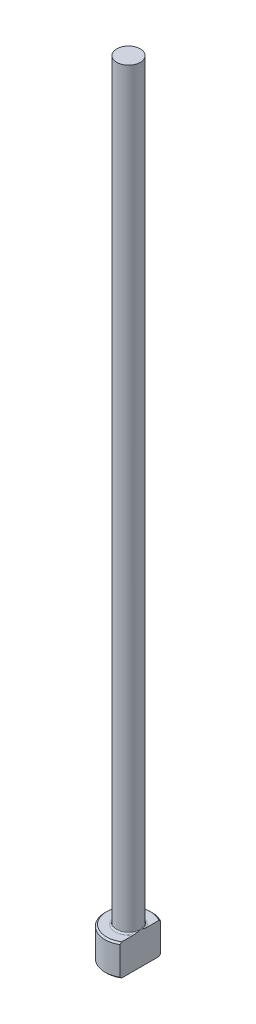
ISO-10303-21;
HEADER;
FILE_DESCRIPTION(('STEP AP214'),'2;1');
FILE_NAME('part.step','',(''),(''),'','','');
FILE_SCHEMA(('AUTOMOTIVE_DESIGN { 1 0 10303 214 1 1 1 1 }'));
ENDSEC;
DATA;
#1=APPLICATION_CONTEXT('core data for automotive mechanical design processes');
#2=APPLICATION_PROTOCOL_DEFINITION('international standard','automotive_design',2000,#1);
#3=PRODUCT_CONTEXT('',#1,'mechanical');
#4=PRODUCT('Part','Part','',(#3));
#5=PRODUCT_RELATED_PRODUCT_CATEGORY('part','',(#4));
#6=PRODUCT_DEFINITION_FORMATION('','',#4);
#7=PRODUCT_DEFINITION_CONTEXT('part definition',#1,'design');
#8=PRODUCT_DEFINITION('design','',#6,#7);
#9=PRODUCT_DEFINITION_SHAPE('','',#8);
#10=(LENGTH_UNIT() NAMED_UNIT(*) SI_UNIT(.MILLI.,.METRE.));
#11=(NAMED_UNIT(*) PLANE_ANGLE_UNIT() SI_UNIT($,.RADIAN.));
#12=(NAMED_UNIT(*) SI_UNIT($,.STERADIAN.) SOLID_ANGLE_UNIT());
#13=UNCERTAINTY_MEASURE_WITH_UNIT(LENGTH_MEASURE(1.E-05),#10,'distance_accuracy_value','');
#14=(GEOMETRIC_REPRESENTATION_CONTEXT(3) GLOBAL_UNCERTAINTY_ASSIGNED_CONTEXT((#13)) GLOBAL_UNIT_ASSIGNED_CONTEXT((#10,
#11,#12)) REPRESENTATION_CONTEXT('',''));
#15=CARTESIAN_POINT('',(0.,0.,0.));
#16=DIRECTION('',(0.,0.,1.));
#17=DIRECTION('',(1.,0.,0.));
#18=AXIS2_PLACEMENT_3D('',#15,#16,#17);
#19=CARTESIAN_POINT('',(0.,0.,0.));
#20=DIRECTION('',(0.,-1.,0.));
#21=DIRECTION('',(0.,0.,-1.));
#22=AXIS2_PLACEMENT_3D('',#19,#20,#21);
#23=PLANE('',#22);
#24=CARTESIAN_POINT('',(0.,0.,0.));
#25=DIRECTION('',(0.,-1.,0.));
#26=DIRECTION('',(0.,0.,-1.));
#27=AXIS2_PLACEMENT_3D('',#24,#25,#26);
#28=CIRCLE('',#27,2.79999999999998);
#29=CARTESIAN_POINT('',(1.49999999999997,0.,2.36431808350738));
#30=VERTEX_POINT('',#29);
#31=CARTESIAN_POINT('',(1.49999999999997,0.,-2.36431808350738));
#32=VERTEX_POINT('',#31);
#33=EDGE_CURVE('E98',#30,#32,#28,.T.);
#34=ORIENTED_EDGE('',*,*,#33,.T.);
#35=DIRECTION('',(0.,0.,1.));
#36=VECTOR('',#35,1.);
#37=CARTESIAN_POINT('',(1.49999999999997,0.,2.5980762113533));
#38=LINE('',#37,#36);
#39=EDGE_CURVE('E83',#32,#30,#38,.T.);
#40=ORIENTED_EDGE('',*,*,#39,.T.);
#41=EDGE_LOOP('',(#34,#40));
#42=FACE_BOUND('',#41,.T.);
#43=ADVANCED_FACE('F32',(#42),#23,.T.);
#44=CARTESIAN_POINT('',(0.,259.958771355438,0.));
#45=DIRECTION('',(0.,1.,0.));
#46=DIRECTION('',(0.,0.,1.));
#47=AXIS2_PLACEMENT_3D('',#44,#45,#46);
#48=CYLINDRICAL_SURFACE('',#47,2.99999999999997);
#49=CARTESIAN_POINT('',(0.,3.80000000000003,0.));
#50=DIRECTION('',(0.,1.,0.));
#51=DIRECTION('',(0.,0.,1.));
#52=AXIS2_PLACEMENT_3D('',#49,#50,#51);
#53=CIRCLE('',#52,2.99999999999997);
#54=CARTESIAN_POINT('',(1.49999999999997,3.80000000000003,2.5980762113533));
#55=VERTEX_POINT('',#54);
#56=CARTESIAN_POINT('',(1.49999999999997,3.80000000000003,-2.5980762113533));
#57=VERTEX_POINT('',#56);
#58=EDGE_CURVE('E104',#55,#57,#53,.F.);
#59=ORIENTED_EDGE('',*,*,#58,.T.);
#60=DIRECTION('',(0.,-1.,0.));
#61=VECTOR('',#60,1.);
#62=CARTESIAN_POINT('',(1.49999999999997,100.,-2.5980762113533));
#63=LINE('',#62,#61);
#64=CARTESIAN_POINT('',(1.49999999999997,0.199999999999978,-2.5980762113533));
#65=VERTEX_POINT('',#64);
#66=EDGE_CURVE('E183',#57,#65,#63,.T.);
#67=ORIENTED_EDGE('',*,*,#66,.T.);
#68=CARTESIAN_POINT('',(0.,0.199999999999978,0.));
#69=DIRECTION('',(0.,-1.,0.));
#70=DIRECTION('',(0.,0.,-1.));
#71=AXIS2_PLACEMENT_3D('',#68,#69,#70);
#72=CIRCLE('',#71,2.99999999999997);
#73=CARTESIAN_POINT('',(1.49999999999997,0.199999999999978,2.5980762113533));
#74=VERTEX_POINT('',#73);
#75=EDGE_CURVE('E100',#65,#74,#72,.F.);
#76=ORIENTED_EDGE('',*,*,#75,.T.);
#77=DIRECTION('',(0.,-1.,0.));
#78=VECTOR('',#77,1.);
#79=CARTESIAN_POINT('',(1.49999999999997,100.,2.5980762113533));
#80=LINE('',#79,#78);
#81=EDGE_CURVE('E93',#55,#74,#80,.T.);
#82=ORIENTED_EDGE('',*,*,#81,.F.);
#83=EDGE_LOOP('',(#59,#67,#76,#82));
#84=FACE_BOUND('',#83,.T.);
#85=ADVANCED_FACE('F158',(#84),#48,.T.);
#86=CARTESIAN_POINT('',(-2.99999999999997,4.,0.));
#87=DIRECTION('',(0.,1.,0.));
#88=DIRECTION('',(0.,0.,1.));
#89=AXIS2_PLACEMENT_3D('',#86,#87,#88);
#90=PLANE('',#89);
#91=CARTESIAN_POINT('',(0.,4.,0.));
#92=DIRECTION('',(0.,1.,0.));
#93=DIRECTION('',(0.,0.,1.));
#94=AXIS2_PLACEMENT_3D('',#91,#92,#93);
#95=CIRCLE('',#94,2.8);
#96=CARTESIAN_POINT('',(1.49999999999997,4.,-2.3643180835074));
#97=VERTEX_POINT('',#96);
#98=CARTESIAN_POINT('',(1.49999999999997,4.,2.3643180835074));
#99=VERTEX_POINT('',#98);
#100=EDGE_CURVE('E178',#97,#99,#95,.T.);
#101=ORIENTED_EDGE('',*,*,#100,.T.);
#102=DIRECTION('',(0.,0.,-1.));
#103=VECTOR('',#102,1.);
#104=CARTESIAN_POINT('',(1.49999999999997,4.,0.));
#105=LINE('',#104,#103);
#106=CARTESIAN_POINT('',(1.49999999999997,3.99999999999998,0.799999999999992));
#107=VERTEX_POINT('',#106);
#108=EDGE_CURVE('E57',#99,#107,#105,.T.);
#109=ORIENTED_EDGE('',*,*,#108,.T.);
#110=CARTESIAN_POINT('',(0.,4.,0.));
#111=DIRECTION('',(0.,1.,0.));
#112=DIRECTION('',(0.,0.,1.));
#113=AXIS2_PLACEMENT_3D('',#110,#111,#112);
#114=CIRCLE('',#113,1.69999999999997);
#115=CARTESIAN_POINT('',(1.49999999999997,3.99999999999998,-0.799999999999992));
#116=VERTEX_POINT('',#115);
#117=EDGE_CURVE('E107',#107,#116,#114,.F.);
#118=ORIENTED_EDGE('',*,*,#117,.T.);
#119=EDGE_CURVE('E136',#116,#97,#105,.T.);
#120=ORIENTED_EDGE('',*,*,#119,.T.);
#121=EDGE_LOOP('',(#101,#109,#118,#120));
#122=FACE_BOUND('',#121,.T.);
#123=ADVANCED_FACE('F147',(#122),#90,.T.);
#124=CARTESIAN_POINT('',(0.,4.,0.));
#125=DIRECTION('',(0.,-1.,0.));
#126=DIRECTION('',(0.,0.,-1.));
#127=AXIS2_PLACEMENT_3D('',#124,#125,#126);
#128=CONICAL_SURFACE('',#127,2.8,0.785398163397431);
#129=ORIENTED_EDGE('',*,*,#58,.F.);
#130=CARTESIAN_POINT('',(1.49999999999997,0.888258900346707,5.71827621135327));
#131=CARTESIAN_POINT('',(1.49999999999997,1.01361833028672,5.58866816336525));
#132=CARTESIAN_POINT('',(1.49999999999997,1.13884324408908,5.45892957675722));
#133=CARTESIAN_POINT('',(1.49999999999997,1.38894444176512,5.19911365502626));
#134=CARTESIAN_POINT('',(1.49999999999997,1.51382072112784,5.06903631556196));
#135=CARTESIAN_POINT('',(1.49999999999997,1.76320568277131,4.80840180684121));
#136=CARTESIAN_POINT('',(1.49999999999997,1.88771414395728,4.67784442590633));
#137=CARTESIAN_POINT('',(1.49999999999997,2.13618059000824,4.4162081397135));
#138=CARTESIAN_POINT('',(1.49999999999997,2.26013857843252,4.28512923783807));
#139=CARTESIAN_POINT('',(1.49999999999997,2.50488975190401,4.02490837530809));
#140=CARTESIAN_POINT('',(1.49999999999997,2.62569693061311,3.8957795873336));
#141=CARTESIAN_POINT('',(1.49999999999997,2.86640694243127,3.63668213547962));
#142=CARTESIAN_POINT('',(1.49999999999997,2.9863097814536,3.50671347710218));
#143=CARTESIAN_POINT('',(1.49999999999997,3.22486033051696,3.24567921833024));
#144=CARTESIAN_POINT('',(1.49999999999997,3.34350830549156,3.11461386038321));
#145=CARTESIAN_POINT('',(1.49999999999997,3.57907716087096,2.85094268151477));
#146=CARTESIAN_POINT('',(1.49999999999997,3.69599811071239,2.71833692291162));
#147=CARTESIAN_POINT('',(1.49999999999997,3.88262371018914,2.50255231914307));
#148=CARTESIAN_POINT('',(1.49999999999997,3.9531245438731,2.42006293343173));
#149=CARTESIAN_POINT('',(1.49999999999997,4.09287098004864,2.254010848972));
#150=CARTESIAN_POINT('',(1.49999999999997,4.16211645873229,2.17044804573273));
#151=CARTESIAN_POINT('',(1.49999999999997,4.29964684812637,2.00105967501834));
#152=CARTESIAN_POINT('',(1.49999999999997,4.36791386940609,1.9152195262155));
#153=CARTESIAN_POINT('',(1.49999999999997,4.50205840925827,1.7417139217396));
#154=CARTESIAN_POINT('',(1.49999999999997,4.56793649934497,1.65404891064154));
#155=CARTESIAN_POINT('',(1.49999999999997,4.69728151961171,1.47490236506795));
#156=CARTESIAN_POINT('',(1.49999999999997,4.76069661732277,1.38338308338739));
#157=CARTESIAN_POINT('',(1.49999999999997,4.88239539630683,1.19675661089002));
#158=CARTESIAN_POINT('',(1.49999999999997,4.94067201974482,1.10164473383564));
#159=CARTESIAN_POINT('',(1.49999999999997,5.04841325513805,0.908008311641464));
#160=CARTESIAN_POINT('',(1.49999999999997,5.09797809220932,0.809540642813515));
#161=CARTESIAN_POINT('',(1.49999999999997,5.18432188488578,0.607192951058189));
#162=CARTESIAN_POINT('',(1.49999999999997,5.22114374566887,0.50333247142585));
#163=CARTESIAN_POINT('',(1.49999999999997,5.26099935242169,0.347577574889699));
#164=CARTESIAN_POINT('',(1.49999999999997,5.27157029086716,0.297609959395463));
#165=CARTESIAN_POINT('',(1.49999999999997,5.28794860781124,0.196885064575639));
#166=CARTESIAN_POINT('',(1.49999999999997,5.29375640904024,0.146127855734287));
#167=CARTESIAN_POINT('',(1.49999999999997,5.30019707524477,0.0444388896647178));
#168=CARTESIAN_POINT('',(1.49999999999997,5.30084594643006,-0.00649183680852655));
#169=CARTESIAN_POINT('',(1.49999999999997,5.29696416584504,-0.108155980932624));
#170=CARTESIAN_POINT('',(1.49999999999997,5.29243308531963,-0.158889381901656));
#171=CARTESIAN_POINT('',(1.49999999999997,5.27856915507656,-0.25923447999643));
#172=CARTESIAN_POINT('',(1.49999999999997,5.26927821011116,-0.308852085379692));
#173=CARTESIAN_POINT('',(1.49999999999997,5.24647108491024,-0.407110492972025));
#174=CARTESIAN_POINT('',(1.49999999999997,5.23295324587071,-0.455750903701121));
#175=CARTESIAN_POINT('',(1.49999999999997,5.20226175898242,-0.552149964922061));
#176=CARTESIAN_POINT('',(1.49999999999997,5.18506801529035,-0.599902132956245));
#177=CARTESIAN_POINT('',(1.49999999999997,5.14771387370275,-0.694205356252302));
#178=CARTESIAN_POINT('',(1.49999999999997,5.12755408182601,-0.740756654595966));
#179=CARTESIAN_POINT('',(1.49999999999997,5.06327696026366,-0.879166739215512));
#180=CARTESIAN_POINT('',(1.49999999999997,5.0155172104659,-0.969329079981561));
#181=CARTESIAN_POINT('',(1.49999999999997,4.9136790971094,-1.14604316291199));
#182=CARTESIAN_POINT('',(1.49999999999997,4.85959300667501,-1.2325903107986));
#183=CARTESIAN_POINT('',(1.49999999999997,4.74697968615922,-1.40321348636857));
#184=CARTESIAN_POINT('',(1.49999999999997,4.68843573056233,-1.4872783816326));
#185=CARTESIAN_POINT('',(1.49999999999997,4.56843845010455,-1.65322187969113));
#186=CARTESIAN_POINT('',(1.49999999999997,4.50698656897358,-1.73510153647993));
#187=CARTESIAN_POINT('',(1.49999999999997,4.38115673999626,-1.89829823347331));
#188=CARTESIAN_POINT('',(1.49999999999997,4.31675092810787,-1.97959369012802));
#189=CARTESIAN_POINT('',(1.49999999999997,4.18634068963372,-2.14090082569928));
#190=CARTESIAN_POINT('',(1.49999999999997,4.1203360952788,-2.22091236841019));
#191=CARTESIAN_POINT('',(1.49999999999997,3.92086431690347,-2.45906508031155));
#192=CARTESIAN_POINT('',(1.49999999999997,3.78562663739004,-2.61572090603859));
#193=CARTESIAN_POINT('',(1.49999999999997,3.53554498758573,-2.90006295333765));
#194=CARTESIAN_POINT('',(1.49999999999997,3.42114543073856,-3.02814382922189));
#195=CARTESIAN_POINT('',(1.49999999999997,3.19093557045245,-3.28303767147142));
#196=CARTESIAN_POINT('',(1.49999999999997,3.0751252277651,-3.40985060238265));
#197=CARTESIAN_POINT('',(1.49999999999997,2.72597067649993,-3.78913849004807));
#198=CARTESIAN_POINT('',(1.49999999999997,2.49111760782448,-4.04022177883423));
#199=CARTESIAN_POINT('',(1.49999999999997,2.02882478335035,-4.52992803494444));
#200=CARTESIAN_POINT('',(1.49999999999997,1.80147747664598,-4.76863870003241));
#201=CARTESIAN_POINT('',(1.49999999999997,1.45954865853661,-5.12558036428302));
#202=CARTESIAN_POINT('',(1.49999999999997,1.34548484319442,-5.24430773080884));
#203=CARTESIAN_POINT('',(1.49999999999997,1.11707176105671,-5.48148573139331));
#204=CARTESIAN_POINT('',(1.49999999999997,1.00272249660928,-5.59993636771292));
#205=CARTESIAN_POINT('',(1.49999999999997,0.888258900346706,-5.71827621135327));
#206=B_SPLINE_CURVE_WITH_KNOTS('',3,(#130,#131,#132,#133,#134,#135,#136,#137,#138,#139,#140,
#141,#142,#143,#144,#145,#146,#147,#148,#149,#150,#151,#152,#153,#154,#155,#156,#157,#158,#159,
#160,#161,#162,#163,#164,#165,#166,#167,#168,#169,#170,#171,#172,#173,#174,#175,#176,#177,#178,
#179,#180,#181,#182,#183,#184,#185,#186,#187,#188,#189,#190,#191,#192,#193,#194,#195,#196,#197,
#198,#199,#200,#201,#202,#203,#204,#205),.UNSPECIFIED.,.F.,.F.,(4,2,2,2,2,2,2,2,2,2,2,2,2,2,2,2,
2,2,2,2,2,2,2,2,2,2,2,2,2,2,2,2,2,2,2,2,2,4),(0.,0.540943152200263,1.08189327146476,
1.62312052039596,2.16434426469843,2.69482920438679,3.22531067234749,3.75567781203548,
4.28602356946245,4.611550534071,4.9371094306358,5.26610945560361,5.59503024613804,
5.92894782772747,6.26331713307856,6.59354403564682,6.92264800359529,7.07567478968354,
7.22868799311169,7.38122626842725,7.53377717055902,7.6850075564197,7.83629736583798,
7.98843643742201,8.14054446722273,8.44618799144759,8.75220879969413,9.05944044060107,
9.3665211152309,9.6776428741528,9.98879742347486,10.609592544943,11.1247803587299,
11.6399825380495,12.6713544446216,13.6603005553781,14.1542238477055,14.6481430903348),.UNSPECIFIED.);
#207=EDGE_CURVE('E135',#55,#99,#206,.T.);
#208=ORIENTED_EDGE('',*,*,#207,.T.);
#209=ORIENTED_EDGE('',*,*,#100,.F.);
#210=EDGE_CURVE('E127',#97,#57,#206,.T.);
#211=ORIENTED_EDGE('',*,*,#210,.T.);
#212=EDGE_LOOP('',(#129,#208,#209,#211));
#213=FACE_BOUND('',#212,.T.);
#214=ADVANCED_FACE('F143',(#213),#128,.T.);
#215=CARTESIAN_POINT('',(0.,0.199999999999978,0.));
#216=DIRECTION('',(0.,1.,0.));
#217=DIRECTION('',(0.,0.,1.));
#218=AXIS2_PLACEMENT_3D('',#215,#216,#217);
#219=CONICAL_SURFACE('',#218,2.99999999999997,0.785398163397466);
#220=ORIENTED_EDGE('',*,*,#75,.F.);
#221=CARTESIAN_POINT('',(1.49999999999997,3.11174109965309,-5.71827621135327));
#222=CARTESIAN_POINT('',(1.49999999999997,2.9863816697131,-5.58866816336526));
#223=CARTESIAN_POINT('',(1.49999999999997,2.86115675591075,-5.45892957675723));
#224=CARTESIAN_POINT('',(1.49999999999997,2.61105555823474,-5.19911365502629));
#225=CARTESIAN_POINT('',(1.49999999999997,2.48617927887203,-5.06903631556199));
#226=CARTESIAN_POINT('',(1.49999999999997,2.23679431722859,-4.80840180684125));
#227=CARTESIAN_POINT('',(1.49999999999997,2.11228585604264,-4.67784442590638));
#228=CARTESIAN_POINT('',(1.49999999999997,1.86381940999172,-4.41620813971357));
#229=CARTESIAN_POINT('',(1.49999999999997,1.73986142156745,-4.28512923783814));
#230=CARTESIAN_POINT('',(1.49999999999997,1.49511024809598,-4.02490837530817));
#231=CARTESIAN_POINT('',(1.49999999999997,1.3743030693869,-3.89577958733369));
#232=CARTESIAN_POINT('',(1.49999999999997,1.13359305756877,-3.63668213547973));
#233=CARTESIAN_POINT('',(1.49999999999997,1.01369021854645,-3.50671347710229));
#234=CARTESIAN_POINT('',(1.49999999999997,0.775139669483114,-3.24567921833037));
#235=CARTESIAN_POINT('',(1.49999999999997,0.656491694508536,-3.11461386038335));
#236=CARTESIAN_POINT('',(1.49999999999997,0.420922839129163,-2.85094268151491));
#237=CARTESIAN_POINT('',(1.49999999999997,0.304001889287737,-2.71833692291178));
#238=CARTESIAN_POINT('',(1.49999999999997,0.117376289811,-2.50255231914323));
#239=CARTESIAN_POINT('',(1.49999999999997,0.0468754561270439,-2.42006293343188));
#240=CARTESIAN_POINT('',(1.49999999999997,-0.0928709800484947,-2.25401084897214));
#241=CARTESIAN_POINT('',(1.49999999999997,-0.162116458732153,-2.17044804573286));
#242=CARTESIAN_POINT('',(1.49999999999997,-0.299646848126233,-2.00105967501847));
#243=CARTESIAN_POINT('',(1.49999999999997,-0.367913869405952,-1.91521952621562));
#244=CARTESIAN_POINT('',(1.49999999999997,-0.502058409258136,-1.74171392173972));
#245=CARTESIAN_POINT('',(1.49999999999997,-0.567936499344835,-1.65404891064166));
#246=CARTESIAN_POINT('',(1.49999999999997,-0.697281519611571,-1.47490236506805));
#247=CARTESIAN_POINT('',(1.49999999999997,-0.760696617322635,-1.38338308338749));
#248=CARTESIAN_POINT('',(1.49999999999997,-0.882395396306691,-1.19675661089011));
#249=CARTESIAN_POINT('',(1.49999999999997,-0.940672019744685,-1.10164473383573));
#250=CARTESIAN_POINT('',(1.49999999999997,-1.04841325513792,-0.908008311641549));
#251=CARTESIAN_POINT('',(1.49999999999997,-1.09797809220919,-0.809540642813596));
#252=CARTESIAN_POINT('',(1.49999999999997,-1.18432188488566,-0.607192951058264));
#253=CARTESIAN_POINT('',(1.49999999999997,-1.22114374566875,-0.503332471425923));
#254=CARTESIAN_POINT('',(1.49999999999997,-1.26099935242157,-0.347577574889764));
#255=CARTESIAN_POINT('',(1.49999999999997,-1.27157029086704,-0.297609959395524));
#256=CARTESIAN_POINT('',(1.49999999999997,-1.28794860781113,-0.19688506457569));
#257=CARTESIAN_POINT('',(1.49999999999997,-1.29375640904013,-0.146127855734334));
#258=CARTESIAN_POINT('',(1.49999999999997,-1.30019707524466,-0.0444388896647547));
#259=CARTESIAN_POINT('',(1.49999999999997,-1.30084594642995,0.00649183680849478));
#260=CARTESIAN_POINT('',(1.49999999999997,-1.29696416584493,0.108155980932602));
#261=CARTESIAN_POINT('',(1.49999999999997,-1.29243308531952,0.158889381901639));
#262=CARTESIAN_POINT('',(1.49999999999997,-1.27856915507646,0.259234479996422));
#263=CARTESIAN_POINT('',(1.49999999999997,-1.26927821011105,0.308852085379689));
#264=CARTESIAN_POINT('',(1.49999999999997,-1.24647108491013,0.407110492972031));
#265=CARTESIAN_POINT('',(1.49999999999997,-1.2329532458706,0.455750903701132));
#266=CARTESIAN_POINT('',(1.49999999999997,-1.20226175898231,0.552149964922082));
#267=CARTESIAN_POINT('',(1.49999999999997,-1.18506801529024,0.59990213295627));
#268=CARTESIAN_POINT('',(1.49999999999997,-1.14771387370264,0.694205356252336));
#269=CARTESIAN_POINT('',(1.49999999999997,-1.1275540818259,0.740756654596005));
#270=CARTESIAN_POINT('',(1.49999999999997,-1.06327696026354,0.879166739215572));
#271=CARTESIAN_POINT('',(1.49999999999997,-1.01551721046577,0.969329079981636));
#272=CARTESIAN_POINT('',(1.49999999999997,-0.913679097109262,1.1460431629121));
#273=CARTESIAN_POINT('',(1.49999999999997,-0.859593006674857,1.23259031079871));
#274=CARTESIAN_POINT('',(1.49999999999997,-0.74697968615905,1.40321348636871));
#275=CARTESIAN_POINT('',(1.49999999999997,-0.688435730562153,1.48727838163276));
#276=CARTESIAN_POINT('',(1.49999999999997,-0.568438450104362,1.65322187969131));
#277=CARTESIAN_POINT('',(1.49999999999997,-0.506986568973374,1.73510153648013));
#278=CARTESIAN_POINT('',(1.49999999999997,-0.381156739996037,1.89829823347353));
#279=CARTESIAN_POINT('',(1.49999999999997,-0.316750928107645,1.97959369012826));
#280=CARTESIAN_POINT('',(1.49999999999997,-0.186340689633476,2.14090082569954));
#281=CARTESIAN_POINT('',(1.49999999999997,-0.120336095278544,2.22091236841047));
#282=CARTESIAN_POINT('',(1.49999999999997,0.0791356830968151,2.45906508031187));
#283=CARTESIAN_POINT('',(1.49999999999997,0.214373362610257,2.61572090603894));
#284=CARTESIAN_POINT('',(1.49999999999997,0.464455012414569,2.900062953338));
#285=CARTESIAN_POINT('',(1.49999999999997,0.578854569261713,3.02814382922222));
#286=CARTESIAN_POINT('',(1.49999999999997,0.809064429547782,3.28303767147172));
#287=CARTESIAN_POINT('',(1.49999999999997,0.924874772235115,3.40985060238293));
#288=CARTESIAN_POINT('',(1.49999999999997,1.27402932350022,3.7891384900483));
#289=CARTESIAN_POINT('',(1.49999999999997,1.50888239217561,4.04022177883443));
#290=CARTESIAN_POINT('',(1.49999999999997,1.97117521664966,4.52992803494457));
#291=CARTESIAN_POINT('',(1.49999999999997,2.19852252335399,4.76863870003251));
#292=CARTESIAN_POINT('',(1.49999999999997,2.54045134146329,5.12558036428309));
#293=CARTESIAN_POINT('',(1.49999999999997,2.65451515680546,5.2443077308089));
#294=CARTESIAN_POINT('',(1.49999999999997,2.88292823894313,5.48148573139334));
#295=CARTESIAN_POINT('',(1.49999999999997,2.99727750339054,5.59993636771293));
#296=CARTESIAN_POINT('',(1.49999999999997,3.11174109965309,5.71827621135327));
#297=B_SPLINE_CURVE_WITH_KNOTS('',3,(#221,#222,#223,#224,#225,#226,#227,#228,#229,#230,#231,
#232,#233,#234,#235,#236,#237,#238,#239,#240,#241,#242,#243,#244,#245,#246,#247,#248,#249,#250,
#251,#252,#253,#254,#255,#256,#257,#258,#259,#260,#261,#262,#263,#264,#265,#266,#267,#268,#269,
#270,#271,#272,#273,#274,#275,#276,#277,#278,#279,#280,#281,#282,#283,#284,#285,#286,#287,#288,
#289,#290,#291,#292,#293,#294,#295,#296),.UNSPECIFIED.,.F.,.F.,(4,2,2,2,2,2,2,2,2,2,2,2,2,2,2,2,
2,2,2,2,2,2,2,2,2,2,2,2,2,2,2,2,2,2,2,2,2,4),(0.,0.540943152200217,1.08189327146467,
1.62312052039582,2.16434426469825,2.69482920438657,3.22531067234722,3.75567781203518,
4.2860235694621,4.61155053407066,4.93710943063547,5.26610945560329,5.59503024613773,
5.92894782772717,6.26331713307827,6.59354403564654,6.92264800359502,7.07567478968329,
7.22868799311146,7.38122626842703,7.53377717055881,7.6850075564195,7.8362973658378,
7.98843643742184,8.14054446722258,8.44618799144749,8.75220879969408,9.05944044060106,
9.36652111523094,9.6776428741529,9.988797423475,10.6095925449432,11.1247803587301,
11.6399825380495,12.6713544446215,13.6603005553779,14.1542238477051,14.6481430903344),.UNSPECIFIED.);
#298=EDGE_CURVE('E86',#65,#32,#297,.T.);
#299=ORIENTED_EDGE('',*,*,#298,.T.);
#300=ORIENTED_EDGE('',*,*,#33,.F.);
#301=EDGE_CURVE('E89',#30,#74,#297,.T.);
#302=ORIENTED_EDGE('',*,*,#301,.T.);
#303=EDGE_LOOP('',(#220,#299,#300,#302));
#304=FACE_BOUND('',#303,.T.);
#305=ADVANCED_FACE('F97',(#304),#219,.T.);
#306=CARTESIAN_POINT('',(0.,4.19999999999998,0.));
#307=DIRECTION('',(0.,1.,0.));
#308=DIRECTION('',(0.,0.,1.));
#309=AXIS2_PLACEMENT_3D('',#306,#307,#308);
#310=TOROIDAL_SURFACE('',#309,1.69999999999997,0.2);
#311=CARTESIAN_POINT('',(1.49999999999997,4.19999999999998,0.));
#312=CARTESIAN_POINT('',(1.49999999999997,4.20000050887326,7.14686072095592E-11));
#313=CARTESIAN_POINT('',(1.49999999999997,4.20000101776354,-1.21663673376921E-07));
#314=CARTESIAN_POINT('',(1.49999999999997,4.20000199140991,-4.97616237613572E-07));
#315=CARTESIAN_POINT('',(1.49999999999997,4.20000245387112,-7.5651622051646E-07));
#316=CARTESIAN_POINT('',(1.49999999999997,4.20000338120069,-1.37642837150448E-06));
#317=CARTESIAN_POINT('',(1.49999999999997,4.20000384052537,-1.74563476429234E-06));
#318=CARTESIAN_POINT('',(1.49999999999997,4.20000469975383,-2.53565984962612E-06));
#319=CARTESIAN_POINT('',(1.49999999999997,4.20000510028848,-2.95582597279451E-06));
#320=CARTESIAN_POINT('',(1.49999999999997,4.20000646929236,-4.48430445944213E-06));
#321=CARTESIAN_POINT('',(1.49999999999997,4.20000736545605,-5.65861039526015E-06));
#322=CARTESIAN_POINT('',(1.49999999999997,4.20000893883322,-8.06479202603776E-06));
#323=CARTESIAN_POINT('',(1.49999999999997,4.20000962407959,-9.29170517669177E-06));
#324=CARTESIAN_POINT('',(1.49999999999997,4.20001225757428,-1.416232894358E-05));
#325=CARTESIAN_POINT('',(1.49999999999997,4.20001407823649,-1.78790031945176E-05));
#326=CARTESIAN_POINT('',(1.49999999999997,4.20001699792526,-2.51443066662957E-05));
#327=CARTESIAN_POINT('',(1.49999999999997,4.20001815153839,-2.86715394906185E-05));
#328=CARTESIAN_POINT('',(1.49999999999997,4.20002315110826,-4.39218128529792E-05));
#329=CARTESIAN_POINT('',(1.49999999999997,4.20002701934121,-5.56288390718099E-05));
#330=CARTESIAN_POINT('',(1.49999999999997,4.20003312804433,-7.7405829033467E-05));
#331=CARTESIAN_POINT('',(1.49999999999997,4.20003553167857,-8.7427841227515E-05));
#332=CARTESIAN_POINT('',(1.49999999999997,4.20005483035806,-0.000161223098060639));
#333=CARTESIAN_POINT('',(1.49999999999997,4.20007979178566,-0.000222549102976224));
#334=CARTESIAN_POINT('',(1.49999999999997,4.20017391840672,-0.000462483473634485));
#335=CARTESIAN_POINT('',(1.49999999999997,4.20023706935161,-0.000642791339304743));
#336=CARTESIAN_POINT('',(1.49999999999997,4.20048761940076,-0.00134785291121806));
#337=CARTESIAN_POINT('',(1.49999999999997,4.20068132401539,-0.00187087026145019));
#338=CARTESIAN_POINT('',(1.49999999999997,4.20147357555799,-0.00402004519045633));
#339=CARTESIAN_POINT('',(1.49999999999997,4.20206499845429,-0.00564811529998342));
#340=CARTESIAN_POINT('',(1.49999999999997,4.20892634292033,-0.0245232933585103));
#341=CARTESIAN_POINT('',(1.49999999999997,4.21523683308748,-0.0417598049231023));
#342=CARTESIAN_POINT('',(1.49999999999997,4.22755028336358,-0.0756091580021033));
#343=CARTESIAN_POINT('',(1.49999999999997,4.23355589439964,-0.0922211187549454));
#344=CARTESIAN_POINT('',(1.49999999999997,4.24620101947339,-0.12745424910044));
#345=CARTESIAN_POINT('',(1.49999999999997,4.25283080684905,-0.146078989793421));
#346=CARTESIAN_POINT('',(1.49999999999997,4.26599765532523,-0.183577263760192));
#347=CARTESIAN_POINT('',(1.49999999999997,4.27253305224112,-0.202451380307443));
#348=CARTESIAN_POINT('',(1.49999999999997,4.28834228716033,-0.248982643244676));
#349=CARTESIAN_POINT('',(1.49999999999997,4.2974915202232,-0.276682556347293));
#350=CARTESIAN_POINT('',(1.49999999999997,4.31490935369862,-0.331625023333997));
#351=CARTESIAN_POINT('',(1.49999999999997,4.32319386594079,-0.35886250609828));
#352=CARTESIAN_POINT('',(1.49999999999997,4.34051594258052,-0.419125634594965));
#353=CARTESIAN_POINT('',(1.49999999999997,4.34936607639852,-0.452206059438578));
#354=CARTESIAN_POINT('',(1.49999999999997,4.36549583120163,-0.519023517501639));
#355=CARTESIAN_POINT('',(1.49999999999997,4.37276283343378,-0.55276364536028));
#356=CARTESIAN_POINT('',(1.49999999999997,4.38554755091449,-0.623053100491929));
#357=CARTESIAN_POINT('',(1.49999999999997,4.39090573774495,-0.659632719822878));
#358=CARTESIAN_POINT('',(1.49999999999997,4.39825016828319,-0.733028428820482));
#359=CARTESIAN_POINT('',(1.49999999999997,4.40024734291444,-0.769843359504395));
#360=CARTESIAN_POINT('',(1.49999999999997,4.39970780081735,-0.842856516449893));
#361=CARTESIAN_POINT('',(1.49999999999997,4.39725347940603,-0.87905368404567));
#362=CARTESIAN_POINT('',(1.49999999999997,4.38900085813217,-0.932380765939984));
#363=CARTESIAN_POINT('',(1.49999999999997,4.38553049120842,-0.949868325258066));
#364=CARTESIAN_POINT('',(1.49999999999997,4.37678336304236,-0.984374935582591));
#365=CARTESIAN_POINT('',(1.49999999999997,4.37150943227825,-1.00139467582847));
#366=CARTESIAN_POINT('',(1.49999999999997,4.35869781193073,-1.03479423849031));
#367=CARTESIAN_POINT('',(1.49999999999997,4.3511359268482,-1.05116499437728));
#368=CARTESIAN_POINT('',(1.49999999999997,4.33325333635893,-1.08234828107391));
#369=CARTESIAN_POINT('',(1.49999999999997,4.32294266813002,-1.097166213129));
#370=CARTESIAN_POINT('',(1.49999999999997,4.30512758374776,-1.11714173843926));
#371=CARTESIAN_POINT('',(1.49999999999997,4.29884721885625,-1.1233906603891));
#372=CARTESIAN_POINT('',(1.49999999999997,4.28545950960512,-1.13494695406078));
#373=CARTESIAN_POINT('',(1.49999999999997,4.27835226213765,-1.14025443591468));
#374=CARTESIAN_POINT('',(1.49999999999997,4.26325970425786,-1.14967631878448));
#375=CARTESIAN_POINT('',(1.49999999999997,4.25526534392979,-1.1537764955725));
#376=CARTESIAN_POINT('',(1.49999999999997,4.23863207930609,-1.16034952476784));
#377=CARTESIAN_POINT('',(1.49999999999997,4.22999427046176,-1.16282507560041));
#378=CARTESIAN_POINT('',(1.49999999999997,4.21343922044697,-1.16570267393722));
#379=CARTESIAN_POINT('',(1.49999999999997,4.20555896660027,-1.16631687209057));
#380=CARTESIAN_POINT('',(1.49999999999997,4.18982775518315,-1.16602054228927));
#381=CARTESIAN_POINT('',(1.49999999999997,4.18197679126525,-1.16511036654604));
#382=CARTESIAN_POINT('',(1.49999999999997,4.16747846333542,-1.16204446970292));
#383=CARTESIAN_POINT('',(1.49999999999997,4.16079696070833,-1.16004509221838));
#384=CARTESIAN_POINT('',(1.49999999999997,4.14781700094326,-1.15505972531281));
#385=CARTESIAN_POINT('',(1.49999999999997,4.14151862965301,-1.1520735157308));
#386=CARTESIAN_POINT('',(1.49999999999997,4.12690214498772,-1.14387585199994));
#387=CARTESIAN_POINT('',(1.49999999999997,4.11881436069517,-1.13825400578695));
#388=CARTESIAN_POINT('',(1.49999999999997,4.10364440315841,-1.12578441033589));
#389=CARTESIAN_POINT('',(1.49999999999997,4.09656475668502,-1.11893367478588));
#390=CARTESIAN_POINT('',(1.49999999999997,4.08012297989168,-1.10074342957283));
#391=CARTESIAN_POINT('',(1.49999999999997,4.07136543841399,-1.08886044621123));
#392=CARTESIAN_POINT('',(1.49999999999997,4.05578194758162,-1.06392743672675));
#393=CARTESIAN_POINT('',(1.49999999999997,4.0489571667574,-1.05087671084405));
#394=CARTESIAN_POINT('',(1.49999999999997,4.03273856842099,-1.0147230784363));
#395=CARTESIAN_POINT('',(1.49999999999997,4.02486230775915,-0.990945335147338));
#396=CARTESIAN_POINT('',(1.49999999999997,4.01257693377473,-0.942321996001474));
#397=CARTESIAN_POINT('',(1.49999999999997,4.00820590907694,-0.917467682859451));
#398=CARTESIAN_POINT('',(1.49999999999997,4.00229956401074,-0.867912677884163));
#399=CARTESIAN_POINT('',(1.49999999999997,4.0007128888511,-0.843217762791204));
#400=CARTESIAN_POINT('',(1.49999999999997,3.9996723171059,-0.793746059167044));
#401=CARTESIAN_POINT('',(1.49999999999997,4.0002230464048,-0.768969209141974));
#402=CARTESIAN_POINT('',(1.49999999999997,4.00433101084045,-0.696994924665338));
#403=CARTESIAN_POINT('',(1.49999999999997,4.01016976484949,-0.649931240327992));
#404=CARTESIAN_POINT('',(1.49999999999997,4.02567776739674,-0.559166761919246));
#405=CARTESIAN_POINT('',(1.49999999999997,4.03511950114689,-0.515423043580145));
#406=CARTESIAN_POINT('',(1.49999999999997,4.05693059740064,-0.427590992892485));
#407=CARTESIAN_POINT('',(1.49999999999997,4.06936356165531,-0.383518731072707));
#408=CARTESIAN_POINT('',(1.49999999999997,4.09174953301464,-0.310161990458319));
#409=CARTESIAN_POINT('',(1.49999999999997,4.10119843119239,-0.280718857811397));
#410=CARTESIAN_POINT('',(1.49999999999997,4.12060442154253,-0.222340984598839));
#411=CARTESIAN_POINT('',(1.49999999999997,4.13055519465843,-0.193404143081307));
#412=CARTESIAN_POINT('',(1.49999999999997,4.14973721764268,-0.138756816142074));
#413=CARTESIAN_POINT('',(1.49999999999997,4.15893123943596,-0.113033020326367));
#414=CARTESIAN_POINT('',(1.49999999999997,4.1778803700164,-0.0606351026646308));
#415=CARTESIAN_POINT('',(1.49999999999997,4.18764328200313,-0.0339636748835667));
#416=CARTESIAN_POINT('',(1.49999999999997,4.19793548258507,-0.00564657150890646));
#417=CARTESIAN_POINT('',(1.49999999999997,4.19852751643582,-0.00401699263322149));
#418=CARTESIAN_POINT('',(1.49999999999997,4.19931992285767,-0.00186745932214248));
#419=CARTESIAN_POINT('',(1.49999999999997,4.1995131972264,-0.00134559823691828));
#420=CARTESIAN_POINT('',(1.49999999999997,4.19976322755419,-0.000641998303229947));
#421=CARTESIAN_POINT('',(1.49999999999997,4.19982627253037,-0.000461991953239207));
#422=CARTESIAN_POINT('',(1.49999999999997,4.19992025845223,-0.000222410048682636));
#423=CARTESIAN_POINT('',(1.49999999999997,4.19994519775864,-0.000161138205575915));
#424=CARTESIAN_POINT('',(1.49999999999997,4.19996448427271,-8.74039267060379E-05));
#425=CARTESIAN_POINT('',(1.49999999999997,4.19996688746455,-7.73857556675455E-05));
#426=CARTESIAN_POINT('',(1.49999999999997,4.19997299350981,-5.56173272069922E-05));
#427=CARTESIAN_POINT('',(1.49999999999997,4.19997685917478,-4.39149186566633E-05));
#428=CARTESIAN_POINT('',(1.49999999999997,4.19998185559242,-2.86698156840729E-05));
#429=CARTESIAN_POINT('',(1.49999999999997,4.19998300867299,-2.51431575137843E-05));
#430=CARTESIAN_POINT('',(1.49999999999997,4.19998592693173,-1.78789552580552E-05));
#431=CARTESIAN_POINT('',(1.49999999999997,4.19998774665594,-1.41627846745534E-05));
#432=CARTESIAN_POINT('',(1.49999999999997,4.19999037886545,-9.29264488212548E-06));
#433=CARTESIAN_POINT('',(1.49999999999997,4.19999106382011,-8.06577599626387E-06));
#434=CARTESIAN_POINT('',(1.49999999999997,4.19999263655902,-5.65962639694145E-06));
#435=CARTESIAN_POINT('',(1.49999999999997,4.19999353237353,-4.48530466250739E-06));
#436=CARTESIAN_POINT('',(1.49999999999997,4.19999490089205,-2.95673740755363E-06));
#437=CARTESIAN_POINT('',(1.49999999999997,4.1999953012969,-2.53653208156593E-06));
#438=CARTESIAN_POINT('',(1.49999999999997,4.19999616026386,-1.74640525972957E-06));
#439=CARTESIAN_POINT('',(1.49999999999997,4.19999661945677,-1.37713598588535E-06));
#440=CARTESIAN_POINT('',(1.49999999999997,4.19999754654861,-7.57072336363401E-07));
#441=CARTESIAN_POINT('',(1.49999999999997,4.19999800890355,-4.98087387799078E-07));
#442=CARTESIAN_POINT('',(1.49999999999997,4.19999898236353,-1.21927250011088E-07));
#443=CARTESIAN_POINT('',(1.49999999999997,4.19999949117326,-7.14620692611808E-11));
#444=CARTESIAN_POINT('',(1.49999999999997,4.19999999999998,0.));
#445=B_SPLINE_CURVE_WITH_KNOTS('',3,(#311,#312,#313,#314,#315,#316,#317,#318,#319,#320,#321,
#322,#323,#324,#325,#326,#327,#328,#329,#330,#331,#332,#333,#334,#335,#336,#337,#338,#339,#340,
#341,#342,#343,#344,#345,#346,#347,#348,#349,#350,#351,#352,#353,#354,#355,#356,#357,#358,#359,
#360,#361,#362,#363,#364,#365,#366,#367,#368,#369,#370,#371,#372,#373,#374,#375,#376,#377,#378,
#379,#380,#381,#382,#383,#384,#385,#386,#387,#388,#389,#390,#391,#392,#393,#394,#395,#396,#397,
#398,#399,#400,#401,#402,#403,#404,#405,#406,#407,#408,#409,#410,#411,#412,#413,#414,#415,#416,
#417,#418,#419,#420,#421,#422,#423,#424,#425,#426,#427,#428,#429,#430,#431,#432,#433,#434,#435,
#436,#437,#438,#439,#440,#441,#442,#443,#444),.UNSPECIFIED.,.T.,.F.,(4,2,2,2,2,2,2,2,2,2,2,2,2,
2,2,2,2,2,2,2,2,2,2,2,2,2,2,2,2,2,2,2,2,2,2,2,2,2,2,2,2,2,2,2,2,2,2,2,2,2,2,2,2,2,2,2,2,2,2,2,2,
2,2,2,2,2,4),(0.,1.5268750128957E-06,3.10959387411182E-06,4.86976756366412E-06,
6.60940084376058E-06,1.10202525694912E-05,1.5232779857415E-05,2.76140371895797E-05,
3.87351645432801E-05,7.5718833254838E-05,0.000106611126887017,0.000304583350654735,
0.000878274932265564,0.00255078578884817,0.00774802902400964,0.0628090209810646,
0.115802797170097,0.175110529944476,0.235030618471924,0.322539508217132,0.407938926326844,
0.510638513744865,0.614128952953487,0.724918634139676,0.835347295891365,0.943752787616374,
0.997165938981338,1.05049564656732,1.10441029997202,1.1581307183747,1.18463966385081,
1.21114550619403,1.23795217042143,1.26471419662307,1.28828324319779,1.31184684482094,
1.33268332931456,1.35352446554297,1.38290826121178,1.41236445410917,1.45639976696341,
1.5004616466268,1.5751878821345,1.65071550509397,1.72483484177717,1.79911468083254,
1.94105061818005,2.07520625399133,2.21251544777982,2.30527614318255,2.39707056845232,
2.47902409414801,2.56422207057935,2.56942417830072,2.5710929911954,2.57166572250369,
2.57186352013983,2.5718944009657,2.57193136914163,2.57194248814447,2.57195486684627,
2.57195907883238,2.57196348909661,2.57196522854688,2.57196698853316,2.57196857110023,
2.57197009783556),.UNSPECIFIED.);
#446=CARTESIAN_POINT('',(1.49999999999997,4.19999999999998,0.));
#447=VERTEX_POINT('',#446);
#448=EDGE_CURVE('E11',#116,#447,#445,.T.);
#449=ORIENTED_EDGE('',*,*,#448,.F.);
#450=ORIENTED_EDGE('',*,*,#117,.F.);
#451=CARTESIAN_POINT('',(1.49999999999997,4.19999999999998,0.));
#452=CARTESIAN_POINT('',(1.49999999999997,4.1999994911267,-7.14686002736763E-11));
#453=CARTESIAN_POINT('',(1.49999999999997,4.19999898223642,1.21663673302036E-07));
#454=CARTESIAN_POINT('',(1.49999999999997,4.19999800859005,4.97616237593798E-07));
#455=CARTESIAN_POINT('',(1.49999999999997,4.19999754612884,7.56516220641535E-07));
#456=CARTESIAN_POINT('',(1.49999999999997,4.19999661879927,1.37642837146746E-06));
#457=CARTESIAN_POINT('',(1.49999999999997,4.1999961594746,1.74563476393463E-06));
#458=CARTESIAN_POINT('',(1.49999999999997,4.19999530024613,2.5356598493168E-06));
#459=CARTESIAN_POINT('',(1.49999999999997,4.19999489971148,2.95582597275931E-06));
#460=CARTESIAN_POINT('',(1.49999999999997,4.1999935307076,4.48430446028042E-06));
#461=CARTESIAN_POINT('',(1.49999999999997,4.19999263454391,5.65861039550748E-06));
#462=CARTESIAN_POINT('',(1.49999999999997,4.19999106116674,8.06479202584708E-06));
#463=CARTESIAN_POINT('',(1.49999999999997,4.19999037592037,9.29170517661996E-06));
#464=CARTESIAN_POINT('',(1.49999999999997,4.19998774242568,1.41623289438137E-05));
#465=CARTESIAN_POINT('',(1.49999999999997,4.19998592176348,1.78790031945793E-05));
#466=CARTESIAN_POINT('',(1.49999999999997,4.1999830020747,2.51443066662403E-05));
#467=CARTESIAN_POINT('',(1.49999999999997,4.19998184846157,2.86715394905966E-05));
#468=CARTESIAN_POINT('',(1.49999999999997,4.1999768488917,4.39218128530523E-05));
#469=CARTESIAN_POINT('',(1.49999999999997,4.19997298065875,5.56288390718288E-05));
#470=CARTESIAN_POINT('',(1.49999999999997,4.19996687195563,7.74058290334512E-05));
#471=CARTESIAN_POINT('',(1.49999999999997,4.1999644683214,8.7427841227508E-05));
#472=CARTESIAN_POINT('',(1.49999999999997,4.1999451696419,0.000161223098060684));
#473=CARTESIAN_POINT('',(1.49999999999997,4.1999202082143,0.000222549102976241));
#474=CARTESIAN_POINT('',(1.49999999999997,4.19982608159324,0.000462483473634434));
#475=CARTESIAN_POINT('',(1.49999999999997,4.19976293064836,0.000642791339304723));
#476=CARTESIAN_POINT('',(1.49999999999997,4.1995123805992,0.00134785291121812));
#477=CARTESIAN_POINT('',(1.49999999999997,4.19931867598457,0.00187087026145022));
#478=CARTESIAN_POINT('',(1.49999999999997,4.19852642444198,0.00402004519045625));
#479=CARTESIAN_POINT('',(1.49999999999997,4.19793500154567,0.00564811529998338));
#480=CARTESIAN_POINT('',(1.49999999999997,4.19107365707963,0.0245232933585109));
#481=CARTESIAN_POINT('',(1.49999999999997,4.18476316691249,0.0417598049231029));
#482=CARTESIAN_POINT('',(1.49999999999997,4.17244971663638,0.0756091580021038));
#483=CARTESIAN_POINT('',(1.49999999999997,4.16644410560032,0.0922211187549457));
#484=CARTESIAN_POINT('',(1.49999999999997,4.15379898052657,0.12745424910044));
#485=CARTESIAN_POINT('',(1.49999999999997,4.14716919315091,0.146078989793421));
#486=CARTESIAN_POINT('',(1.49999999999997,4.13400234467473,0.183577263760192));
#487=CARTESIAN_POINT('',(1.49999999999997,4.12746694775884,0.202451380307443));
#488=CARTESIAN_POINT('',(1.49999999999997,4.11165771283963,0.248982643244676));
#489=CARTESIAN_POINT('',(1.49999999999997,4.10250847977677,0.276682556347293));
#490=CARTESIAN_POINT('',(1.49999999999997,4.08509064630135,0.331625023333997));
#491=CARTESIAN_POINT('',(1.49999999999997,4.07680613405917,0.35886250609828));
#492=CARTESIAN_POINT('',(1.49999999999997,4.05948405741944,0.419125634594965));
#493=CARTESIAN_POINT('',(1.49999999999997,4.05063392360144,0.452206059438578));
#494=CARTESIAN_POINT('',(1.49999999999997,4.03450416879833,0.51902351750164));
#495=CARTESIAN_POINT('',(1.49999999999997,4.02723716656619,0.55276364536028));
#496=CARTESIAN_POINT('',(1.49999999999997,4.01445244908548,0.623053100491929));
#497=CARTESIAN_POINT('',(1.49999999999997,4.00909426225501,0.659632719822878));
#498=CARTESIAN_POINT('',(1.49999999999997,4.00174983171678,0.733028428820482));
#499=CARTESIAN_POINT('',(1.49999999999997,3.99975265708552,0.769843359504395));
#500=CARTESIAN_POINT('',(1.49999999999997,4.00029219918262,0.842856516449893));
#501=CARTESIAN_POINT('',(1.49999999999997,4.00274652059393,0.87905368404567));
#502=CARTESIAN_POINT('',(1.49999999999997,4.0109991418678,0.932380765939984));
#503=CARTESIAN_POINT('',(1.49999999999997,4.01446950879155,0.949868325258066));
#504=CARTESIAN_POINT('',(1.49999999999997,4.02321663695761,0.984374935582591));
#505=CARTESIAN_POINT('',(1.49999999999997,4.02849056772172,1.00139467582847));
#506=CARTESIAN_POINT('',(1.49999999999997,4.04130218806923,1.03479423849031));
#507=CARTESIAN_POINT('',(1.49999999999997,4.04886407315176,1.05116499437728));
#508=CARTESIAN_POINT('',(1.49999999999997,4.06674666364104,1.08234828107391));
#509=CARTESIAN_POINT('',(1.49999999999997,4.07705733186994,1.097166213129));
#510=CARTESIAN_POINT('',(1.49999999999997,4.09487241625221,1.11714173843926));
#511=CARTESIAN_POINT('',(1.49999999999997,4.10115278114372,1.1233906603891));
#512=CARTESIAN_POINT('',(1.49999999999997,4.11454049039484,1.13494695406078));
#513=CARTESIAN_POINT('',(1.49999999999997,4.12164773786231,1.14025443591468));
#514=CARTESIAN_POINT('',(1.49999999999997,4.13674029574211,1.14967631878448));
#515=CARTESIAN_POINT('',(1.49999999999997,4.14473465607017,1.1537764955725));
#516=CARTESIAN_POINT('',(1.49999999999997,4.16136792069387,1.16034952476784));
#517=CARTESIAN_POINT('',(1.49999999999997,4.1700057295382,1.16282507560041));
#518=CARTESIAN_POINT('',(1.49999999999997,4.18656077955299,1.16570267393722));
#519=CARTESIAN_POINT('',(1.49999999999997,4.19444103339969,1.16631687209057));
#520=CARTESIAN_POINT('',(1.49999999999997,4.21017224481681,1.16602054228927));
#521=CARTESIAN_POINT('',(1.49999999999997,4.21802320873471,1.16511036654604));
#522=CARTESIAN_POINT('',(1.49999999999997,4.23252153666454,1.16204446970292));
#523=CARTESIAN_POINT('',(1.49999999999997,4.23920303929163,1.16004509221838));
#524=CARTESIAN_POINT('',(1.49999999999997,4.2521829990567,1.15505972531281));
#525=CARTESIAN_POINT('',(1.49999999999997,4.25848137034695,1.1520735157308));
#526=CARTESIAN_POINT('',(1.49999999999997,4.27309785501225,1.14387585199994));
#527=CARTESIAN_POINT('',(1.49999999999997,4.28118563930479,1.13825400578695));
#528=CARTESIAN_POINT('',(1.49999999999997,4.29635559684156,1.12578441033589));
#529=CARTESIAN_POINT('',(1.49999999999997,4.30343524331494,1.11893367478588));
#530=CARTESIAN_POINT('',(1.49999999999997,4.31987702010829,1.10074342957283));
#531=CARTESIAN_POINT('',(1.49999999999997,4.32863456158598,1.08886044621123));
#532=CARTESIAN_POINT('',(1.49999999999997,4.34421805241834,1.06392743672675));
#533=CARTESIAN_POINT('',(1.49999999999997,4.35104283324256,1.05087671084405));
#534=CARTESIAN_POINT('',(1.49999999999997,4.36726143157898,1.0147230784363));
#535=CARTESIAN_POINT('',(1.49999999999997,4.37513769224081,0.990945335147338));
#536=CARTESIAN_POINT('',(1.49999999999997,4.38742306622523,0.942321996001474));
#537=CARTESIAN_POINT('',(1.49999999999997,4.39179409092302,0.917467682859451));
#538=CARTESIAN_POINT('',(1.49999999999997,4.39770043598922,0.867912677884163));
#539=CARTESIAN_POINT('',(1.49999999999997,4.39928711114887,0.843217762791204));
#540=CARTESIAN_POINT('',(1.49999999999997,4.40032768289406,0.793746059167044));
#541=CARTESIAN_POINT('',(1.49999999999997,4.39977695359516,0.768969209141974));
#542=CARTESIAN_POINT('',(1.49999999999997,4.39566898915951,0.696994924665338));
#543=CARTESIAN_POINT('',(1.49999999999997,4.38983023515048,0.649931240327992));
#544=CARTESIAN_POINT('',(1.49999999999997,4.37432223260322,0.559166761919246));
#545=CARTESIAN_POINT('',(1.49999999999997,4.36488049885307,0.515423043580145));
#546=CARTESIAN_POINT('',(1.49999999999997,4.34306940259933,0.427590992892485));
#547=CARTESIAN_POINT('',(1.49999999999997,4.33063643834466,0.383518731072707));
#548=CARTESIAN_POINT('',(1.49999999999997,4.30825046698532,0.310161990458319));
#549=CARTESIAN_POINT('',(1.49999999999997,4.29880156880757,0.280718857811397));
#550=CARTESIAN_POINT('',(1.49999999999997,4.27939557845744,0.222340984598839));
#551=CARTESIAN_POINT('',(1.49999999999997,4.26944480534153,0.193404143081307));
#552=CARTESIAN_POINT('',(1.49999999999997,4.25026278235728,0.138756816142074));
#553=CARTESIAN_POINT('',(1.49999999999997,4.241068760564,0.113033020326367));
#554=CARTESIAN_POINT('',(1.49999999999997,4.22211962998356,0.0606351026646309));
#555=CARTESIAN_POINT('',(1.49999999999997,4.21235671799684,0.0339636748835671));
#556=CARTESIAN_POINT('',(1.49999999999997,4.20206451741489,0.00564657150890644));
#557=CARTESIAN_POINT('',(1.49999999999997,4.20147248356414,0.00401699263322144));
#558=CARTESIAN_POINT('',(1.49999999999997,4.20068007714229,0.00186745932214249));
#559=CARTESIAN_POINT('',(1.49999999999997,4.20048680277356,0.00134559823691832));
#560=CARTESIAN_POINT('',(1.49999999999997,4.20023677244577,0.000641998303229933));
#561=CARTESIAN_POINT('',(1.49999999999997,4.2001737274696,0.000461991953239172));
#562=CARTESIAN_POINT('',(1.49999999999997,4.20007974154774,0.000222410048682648));
#563=CARTESIAN_POINT('',(1.49999999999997,4.20005480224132,0.000161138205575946));
#564=CARTESIAN_POINT('',(1.49999999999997,4.20003551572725,8.7403926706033E-05));
#565=CARTESIAN_POINT('',(1.49999999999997,4.20003311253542,7.73857556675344E-05));
#566=CARTESIAN_POINT('',(1.49999999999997,4.20002700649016,5.56173272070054E-05));
#567=CARTESIAN_POINT('',(1.49999999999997,4.20002314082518,4.39149186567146E-05));
#568=CARTESIAN_POINT('',(1.49999999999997,4.20001814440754,2.86698156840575E-05));
#569=CARTESIAN_POINT('',(1.49999999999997,4.20001699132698,2.51431575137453E-05));
#570=CARTESIAN_POINT('',(1.49999999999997,4.20001407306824,1.78789552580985E-05));
#571=CARTESIAN_POINT('',(1.49999999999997,4.20001225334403,1.41627846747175E-05));
#572=CARTESIAN_POINT('',(1.49999999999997,4.20000962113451,9.29264488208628E-06));
#573=CARTESIAN_POINT('',(1.49999999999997,4.20000893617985,8.06577599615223E-06));
#574=CARTESIAN_POINT('',(1.49999999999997,4.20000736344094,5.65962639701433E-06));
#575=CARTESIAN_POINT('',(1.49999999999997,4.20000646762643,4.48530466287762E-06));
#576=CARTESIAN_POINT('',(1.49999999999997,4.20000509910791,2.95673740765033E-06));
#577=CARTESIAN_POINT('',(1.49999999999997,4.20000469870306,2.53653208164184E-06));
#578=CARTESIAN_POINT('',(1.49999999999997,4.2000038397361,1.7464052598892E-06));
#579=CARTESIAN_POINT('',(1.49999999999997,4.20000338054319,1.37713598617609E-06));
#580=CARTESIAN_POINT('',(1.49999999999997,4.20000245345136,7.57072336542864E-07));
#581=CARTESIAN_POINT('',(1.49999999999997,4.20000199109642,4.98087387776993E-07));
#582=CARTESIAN_POINT('',(1.49999999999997,4.20000101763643,1.2192724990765E-07));
#583=CARTESIAN_POINT('',(1.49999999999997,4.20000050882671,7.14620623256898E-11));
#584=CARTESIAN_POINT('',(1.49999999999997,4.19999999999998,0.));
#585=B_SPLINE_CURVE_WITH_KNOTS('',3,(#451,#452,#453,#454,#455,#456,#457,#458,#459,#460,#461,
#462,#463,#464,#465,#466,#467,#468,#469,#470,#471,#472,#473,#474,#475,#476,#477,#478,#479,#480,
#481,#482,#483,#484,#485,#486,#487,#488,#489,#490,#491,#492,#493,#494,#495,#496,#497,#498,#499,
#500,#501,#502,#503,#504,#505,#506,#507,#508,#509,#510,#511,#512,#513,#514,#515,#516,#517,#518,
#519,#520,#521,#522,#523,#524,#525,#526,#527,#528,#529,#530,#531,#532,#533,#534,#535,#536,#537,
#538,#539,#540,#541,#542,#543,#544,#545,#546,#547,#548,#549,#550,#551,#552,#553,#554,#555,#556,
#557,#558,#559,#560,#561,#562,#563,#564,#565,#566,#567,#568,#569,#570,#571,#572,#573,#574,#575,
#576,#577,#578,#579,#580,#581,#582,#583,#584),.UNSPECIFIED.,.T.,.F.,(4,2,2,2,2,2,2,2,2,2,2,2,2,
2,2,2,2,2,2,2,2,2,2,2,2,2,2,2,2,2,2,2,2,2,2,2,2,2,2,2,2,2,2,2,2,2,2,2,2,2,2,2,2,2,2,2,2,2,2,2,2,
2,2,2,2,2,4),(0.,1.52687501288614E-06,3.10959387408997E-06,4.86976756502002E-06,
6.60940084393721E-06,1.10202525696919E-05,1.52327798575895E-05,2.76140371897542E-05,
3.87351645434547E-05,7.57188332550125E-05,0.000106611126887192,0.000304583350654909,
0.000878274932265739,0.00255078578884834,0.00774802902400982,0.0628090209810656,
0.115802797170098,0.175110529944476,0.235030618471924,0.322539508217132,0.407938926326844,
0.510638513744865,0.614128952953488,0.724918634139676,0.835347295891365,0.943752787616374,
0.997165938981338,1.05049564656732,1.10441029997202,1.1581307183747,1.18463966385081,
1.21114550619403,1.23795217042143,1.26471419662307,1.28828324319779,1.31184684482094,
1.33268332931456,1.35352446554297,1.38290826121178,1.41236445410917,1.45639976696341,
1.5004616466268,1.5751878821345,1.65071550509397,1.72483484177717,1.79911468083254,
1.94105061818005,2.07520625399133,2.21251544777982,2.30527614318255,2.39707056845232,
2.47902409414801,2.56422207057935,2.56942417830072,2.5710929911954,2.57166572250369,
2.57186352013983,2.5718944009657,2.57193136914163,2.57194248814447,2.57195486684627,
2.57195907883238,2.57196348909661,2.57196522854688,2.57196698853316,2.57196857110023,
2.57197009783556),.UNSPECIFIED.);
#586=EDGE_CURVE('E46',#447,#107,#585,.T.);
#587=ORIENTED_EDGE('',*,*,#586,.F.);
#588=CARTESIAN_POINT('',(0.,4.19999999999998,0.));
#589=DIRECTION('',(0.,1.,0.));
#590=DIRECTION('',(0.,0.,1.));
#591=AXIS2_PLACEMENT_3D('',#588,#589,#590);
#592=CIRCLE('',#591,1.49999999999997);
#593=EDGE_CURVE('E103',#447,#447,#592,.T.);
#594=ORIENTED_EDGE('',*,*,#593,.F.);
#595=EDGE_LOOP('',(#449,#450,#587,#594));
#596=FACE_BOUND('',#595,.T.);
#597=ADVANCED_FACE('F34',(#596),#310,.F.);
#598=CARTESIAN_POINT('',(0.,259.958771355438,0.));
#599=DIRECTION('',(0.,1.,0.));
#600=DIRECTION('',(0.,0.,1.));
#601=AXIS2_PLACEMENT_3D('',#598,#599,#600);
#602=CYLINDRICAL_SURFACE('',#601,1.49999999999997);
#603=ORIENTED_EDGE('',*,*,#593,.T.);
#604=EDGE_LOOP('',(#603));
#605=FACE_BOUND('',#604,.T.);
#606=CARTESIAN_POINT('',(0.,100.,0.));
#607=DIRECTION('',(0.,1.,0.));
#608=DIRECTION('',(0.,0.,1.));
#609=AXIS2_PLACEMENT_3D('',#606,#607,#608);
#610=CIRCLE('',#609,1.49999999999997);
#611=CARTESIAN_POINT('',(0.,100.,1.49999999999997));
#612=VERTEX_POINT('',#611);
#613=EDGE_CURVE('E101',#612,#612,#610,.T.);
#614=ORIENTED_EDGE('',*,*,#613,.F.);
#615=EDGE_LOOP('',(#614));
#616=FACE_BOUND('',#615,.T.);
#617=ADVANCED_FACE('F155',(#605,#616),#602,.T.);
#618=CARTESIAN_POINT('',(-1.49999999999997,100.,0.));
#619=DIRECTION('',(0.,1.,0.));
#620=DIRECTION('',(0.,0.,1.));
#621=AXIS2_PLACEMENT_3D('',#618,#619,#620);
#622=PLANE('',#621);
#623=ORIENTED_EDGE('',*,*,#613,.T.);
#624=EDGE_LOOP('',(#623));
#625=FACE_BOUND('',#624,.T.);
#626=ADVANCED_FACE('F121',(#625),#622,.T.);
#627=CARTESIAN_POINT('',(1.49999999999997,100.,2.5980762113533));
#628=DIRECTION('',(1.,0.,0.));
#629=DIRECTION('',(0.,0.,-1.));
#630=AXIS2_PLACEMENT_3D('',#627,#628,#629);
#631=PLANE('',#630);
#632=ORIENTED_EDGE('',*,*,#66,.F.);
#633=ORIENTED_EDGE('',*,*,#210,.F.);
#634=ORIENTED_EDGE('',*,*,#119,.F.);
#635=ORIENTED_EDGE('',*,*,#448,.T.);
#636=ORIENTED_EDGE('',*,*,#586,.T.);
#637=ORIENTED_EDGE('',*,*,#108,.F.);
#638=ORIENTED_EDGE('',*,*,#207,.F.);
#639=ORIENTED_EDGE('',*,*,#81,.T.);
#640=ORIENTED_EDGE('',*,*,#301,.F.);
#641=ORIENTED_EDGE('',*,*,#39,.F.);
#642=ORIENTED_EDGE('',*,*,#298,.F.);
#643=EDGE_LOOP('',(#632,#633,#634,#635,#636,#637,#638,#639,#640,#641,#642));
#644=FACE_BOUND('',#643,.T.);
#645=ADVANCED_FACE('F85',(#644),#631,.T.);
#646=CLOSED_SHELL('',(#43,#85,#123,#214,#305,#597,#617,#626,#645));
#647=MANIFOLD_SOLID_BREP('B2',#646);
#648=ADVANCED_BREP_SHAPE_REPRESENTATION('',(#18,#647),#14);
#649=SHAPE_DEFINITION_REPRESENTATION(#9,#648);
ENDSEC;
END-ISO-10303-21;
